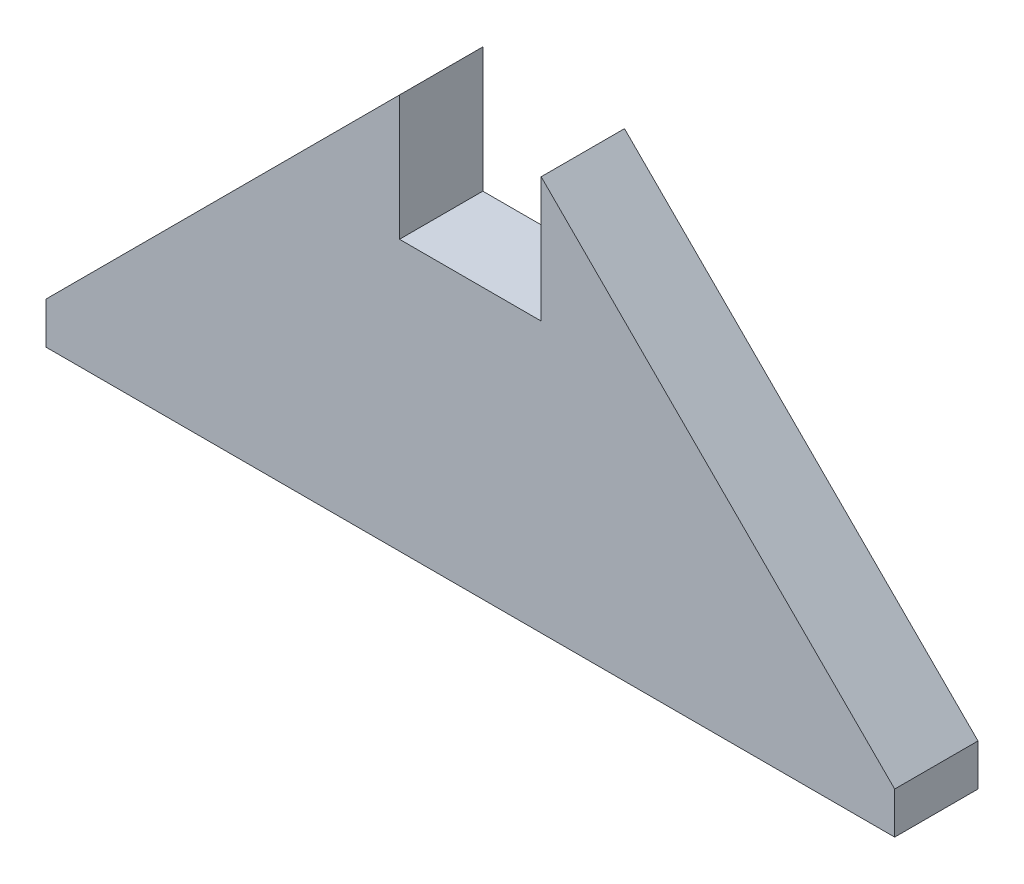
ISO-10303-21;
HEADER;
FILE_DESCRIPTION(('STEP AP214'),'2;1');
FILE_NAME('part.step','',(''),(''),'','','');
FILE_SCHEMA(('AUTOMOTIVE_DESIGN { 1 0 10303 214 1 1 1 1 }'));
ENDSEC;
DATA;
#1=APPLICATION_CONTEXT('core data for automotive mechanical design processes');
#2=APPLICATION_PROTOCOL_DEFINITION('international standard','automotive_design',2000,#1);
#3=PRODUCT_CONTEXT('',#1,'mechanical');
#4=PRODUCT('Part','Part','',(#3));
#5=PRODUCT_RELATED_PRODUCT_CATEGORY('part','',(#4));
#6=PRODUCT_DEFINITION_FORMATION('','',#4);
#7=PRODUCT_DEFINITION_CONTEXT('part definition',#1,'design');
#8=PRODUCT_DEFINITION('design','',#6,#7);
#9=PRODUCT_DEFINITION_SHAPE('','',#8);
#10=(LENGTH_UNIT() NAMED_UNIT(*) SI_UNIT(.MILLI.,.METRE.));
#11=(NAMED_UNIT(*) PLANE_ANGLE_UNIT() SI_UNIT($,.RADIAN.));
#12=(NAMED_UNIT(*) SI_UNIT($,.STERADIAN.) SOLID_ANGLE_UNIT());
#13=UNCERTAINTY_MEASURE_WITH_UNIT(LENGTH_MEASURE(1.E-05),#10,'distance_accuracy_value','');
#14=(GEOMETRIC_REPRESENTATION_CONTEXT(3) GLOBAL_UNCERTAINTY_ASSIGNED_CONTEXT((#13)) GLOBAL_UNIT_ASSIGNED_CONTEXT((#10,
#11,#12)) REPRESENTATION_CONTEXT('',''));
#15=CARTESIAN_POINT('',(0.,0.,0.));
#16=DIRECTION('',(0.,0.,1.));
#17=DIRECTION('',(1.,0.,0.));
#18=AXIS2_PLACEMENT_3D('',#15,#16,#17);
#19=CARTESIAN_POINT('',(0.,0.,10.));
#20=DIRECTION('',(0.707106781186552,-0.707106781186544,0.));
#21=DIRECTION('',(0.707106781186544,0.707106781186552,0.));
#22=AXIS2_PLACEMENT_3D('',#19,#20,#21);
#23=PLANE('',#22);
#24=DIRECTION('',(-0.707106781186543,-0.707106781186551,0.));
#25=VECTOR('',#24,1.);
#26=CARTESIAN_POINT('',(0.,0.,0.));
#27=LINE('',#26,#25);
#28=CARTESIAN_POINT('',(42.4264068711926,42.4264068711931,0.));
#29=VERTEX_POINT('',#28);
#30=CARTESIAN_POINT('',(0.,0.,0.));
#31=VERTEX_POINT('',#30);
#32=EDGE_CURVE('E129',#29,#31,#27,.T.);
#33=ORIENTED_EDGE('',*,*,#32,.T.);
#34=DIRECTION('',(0.,0.,-1.));
#35=VECTOR('',#34,1.);
#36=CARTESIAN_POINT('',(0.,0.,10.));
#37=LINE('',#36,#35);
#38=CARTESIAN_POINT('',(0.,0.,10.));
#39=VERTEX_POINT('',#38);
#40=EDGE_CURVE('E11',#39,#31,#37,.T.);
#41=ORIENTED_EDGE('',*,*,#40,.F.);
#42=DIRECTION('',(-0.707106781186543,-0.707106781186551,0.));
#43=VECTOR('',#42,1.);
#44=CARTESIAN_POINT('',(0.,0.,10.));
#45=LINE('',#44,#43);
#46=CARTESIAN_POINT('',(42.4264068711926,42.4264068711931,10.));
#47=VERTEX_POINT('',#46);
#48=EDGE_CURVE('E143',#47,#39,#45,.T.);
#49=ORIENTED_EDGE('',*,*,#48,.F.);
#50=DIRECTION('',(0.,0.,-1.));
#51=VECTOR('',#50,1.);
#52=CARTESIAN_POINT('',(42.4264068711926,42.4264068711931,10.));
#53=LINE('',#52,#51);
#54=EDGE_CURVE('E125',#47,#29,#53,.T.);
#55=ORIENTED_EDGE('',*,*,#54,.T.);
#56=EDGE_LOOP('',(#33,#41,#49,#55));
#57=FACE_BOUND('',#56,.T.);
#58=ADVANCED_FACE('F33',(#57),#23,.F.);
#59=CARTESIAN_POINT('',(0.,0.,10.));
#60=DIRECTION('',(1.,0.,0.));
#61=DIRECTION('',(0.,1.,0.));
#62=AXIS2_PLACEMENT_3D('',#59,#60,#61);
#63=PLANE('',#62);
#64=DIRECTION('',(0.,-1.,0.));
#65=VECTOR('',#64,1.);
#66=CARTESIAN_POINT('',(0.,0.,0.));
#67=LINE('',#66,#65);
#68=CARTESIAN_POINT('',(0.,-4.99999999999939,0.));
#69=VERTEX_POINT('',#68);
#70=EDGE_CURVE('E132',#31,#69,#67,.T.);
#71=ORIENTED_EDGE('',*,*,#70,.T.);
#72=DIRECTION('',(0.,0.,-1.));
#73=VECTOR('',#72,1.);
#74=CARTESIAN_POINT('',(0.,-4.99999999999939,10.));
#75=LINE('',#74,#73);
#76=CARTESIAN_POINT('',(0.,-4.99999999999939,10.));
#77=VERTEX_POINT('',#76);
#78=EDGE_CURVE('E41',#77,#69,#75,.T.);
#79=ORIENTED_EDGE('',*,*,#78,.F.);
#80=DIRECTION('',(0.,-1.,0.));
#81=VECTOR('',#80,1.);
#82=CARTESIAN_POINT('',(0.,0.,10.));
#83=LINE('',#82,#81);
#84=EDGE_CURVE('E92',#39,#77,#83,.T.);
#85=ORIENTED_EDGE('',*,*,#84,.F.);
#86=ORIENTED_EDGE('',*,*,#40,.T.);
#87=EDGE_LOOP('',(#71,#79,#85,#86));
#88=FACE_BOUND('',#87,.T.);
#89=ADVANCED_FACE('F178',(#88),#63,.F.);
#90=CARTESIAN_POINT('',(0.,-4.99999999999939,10.));
#91=DIRECTION('',(0.,1.,0.));
#92=DIRECTION('',(-1.,0.,0.));
#93=AXIS2_PLACEMENT_3D('',#90,#91,#92);
#94=PLANE('',#93);
#95=DIRECTION('',(1.,0.,0.));
#96=VECTOR('',#95,1.);
#97=CARTESIAN_POINT('',(0.,-4.99999999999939,0.));
#98=LINE('',#97,#96);
#99=CARTESIAN_POINT('',(101.852813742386,-4.99999999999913,0.));
#100=VERTEX_POINT('',#99);
#101=EDGE_CURVE('E134',#69,#100,#98,.T.);
#102=ORIENTED_EDGE('',*,*,#101,.T.);
#103=DIRECTION('',(0.,0.,-1.));
#104=VECTOR('',#103,1.);
#105=CARTESIAN_POINT('',(101.852813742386,-4.99999999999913,10.));
#106=LINE('',#105,#104);
#107=CARTESIAN_POINT('',(101.852813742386,-4.99999999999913,10.));
#108=VERTEX_POINT('',#107);
#109=EDGE_CURVE('E150',#108,#100,#106,.T.);
#110=ORIENTED_EDGE('',*,*,#109,.F.);
#111=DIRECTION('',(1.,0.,0.));
#112=VECTOR('',#111,1.);
#113=CARTESIAN_POINT('',(0.,-4.99999999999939,10.));
#114=LINE('',#113,#112);
#115=EDGE_CURVE('E158',#77,#108,#114,.T.);
#116=ORIENTED_EDGE('',*,*,#115,.F.);
#117=ORIENTED_EDGE('',*,*,#78,.T.);
#118=EDGE_LOOP('',(#102,#110,#116,#117));
#119=FACE_BOUND('',#118,.T.);
#120=ADVANCED_FACE('F156',(#119),#94,.F.);
#121=CARTESIAN_POINT('',(101.852813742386,-4.99999999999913,10.));
#122=DIRECTION('',(-1.,0.,0.));
#123=DIRECTION('',(0.,0.,1.));
#124=AXIS2_PLACEMENT_3D('',#121,#122,#123);
#125=PLANE('',#124);
#126=DIRECTION('',(0.,1.,0.));
#127=VECTOR('',#126,1.);
#128=CARTESIAN_POINT('',(101.852813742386,-4.99999999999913,0.));
#129=LINE('',#128,#127);
#130=CARTESIAN_POINT('',(101.852813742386,8.67688376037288E-13,0.));
#131=VERTEX_POINT('',#130);
#132=EDGE_CURVE('E136',#100,#131,#129,.T.);
#133=ORIENTED_EDGE('',*,*,#132,.T.);
#134=DIRECTION('',(0.,0.,-1.));
#135=VECTOR('',#134,1.);
#136=CARTESIAN_POINT('',(101.852813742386,8.67688376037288E-13,10.));
#137=LINE('',#136,#135);
#138=CARTESIAN_POINT('',(101.852813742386,8.67688376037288E-13,10.));
#139=VERTEX_POINT('',#138);
#140=EDGE_CURVE('E147',#139,#131,#137,.T.);
#141=ORIENTED_EDGE('',*,*,#140,.F.);
#142=DIRECTION('',(0.,1.,0.));
#143=VECTOR('',#142,1.);
#144=CARTESIAN_POINT('',(101.852813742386,-4.99999999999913,10.));
#145=LINE('',#144,#143);
#146=EDGE_CURVE('E170',#108,#139,#145,.T.);
#147=ORIENTED_EDGE('',*,*,#146,.F.);
#148=ORIENTED_EDGE('',*,*,#109,.T.);
#149=EDGE_LOOP('',(#133,#141,#147,#148));
#150=FACE_BOUND('',#149,.T.);
#151=ADVANCED_FACE('F166',(#150),#125,.F.);
#152=CARTESIAN_POINT('',(101.852813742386,8.67688376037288E-13,10.));
#153=DIRECTION('',(-0.707106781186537,-0.707106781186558,0.));
#154=DIRECTION('',(0.707106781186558,-0.707106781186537,0.));
#155=AXIS2_PLACEMENT_3D('',#152,#153,#154);
#156=PLANE('',#155);
#157=DIRECTION('',(-0.707106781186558,0.707106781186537,0.));
#158=VECTOR('',#157,1.);
#159=CARTESIAN_POINT('',(101.852813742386,8.67688376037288E-13,0.));
#160=LINE('',#159,#158);
#161=CARTESIAN_POINT('',(59.4264068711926,42.4264068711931,0.));
#162=VERTEX_POINT('',#161);
#163=EDGE_CURVE('E138',#131,#162,#160,.T.);
#164=ORIENTED_EDGE('',*,*,#163,.T.);
#165=DIRECTION('',(0.,0.,-1.));
#166=VECTOR('',#165,1.);
#167=CARTESIAN_POINT('',(59.4264068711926,42.4264068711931,10.));
#168=LINE('',#167,#166);
#169=CARTESIAN_POINT('',(59.4264068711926,42.4264068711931,10.));
#170=VERTEX_POINT('',#169);
#171=EDGE_CURVE('E120',#170,#162,#168,.T.);
#172=ORIENTED_EDGE('',*,*,#171,.F.);
#173=DIRECTION('',(-0.707106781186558,0.707106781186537,0.));
#174=VECTOR('',#173,1.);
#175=CARTESIAN_POINT('',(101.852813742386,8.67688376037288E-13,10.));
#176=LINE('',#175,#174);
#177=EDGE_CURVE('E111',#139,#170,#176,.T.);
#178=ORIENTED_EDGE('',*,*,#177,.F.);
#179=ORIENTED_EDGE('',*,*,#140,.T.);
#180=EDGE_LOOP('',(#164,#172,#178,#179));
#181=FACE_BOUND('',#180,.T.);
#182=ADVANCED_FACE('F169',(#181),#156,.F.);
#183=CARTESIAN_POINT('',(59.4264068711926,27.4264068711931,10.));
#184=DIRECTION('',(1.,0.,0.));
#185=DIRECTION('',(0.,0.,-1.));
#186=AXIS2_PLACEMENT_3D('',#183,#184,#185);
#187=PLANE('',#186);
#188=DIRECTION('',(0.,-1.,0.));
#189=VECTOR('',#188,1.);
#190=CARTESIAN_POINT('',(59.4264068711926,27.4264068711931,0.));
#191=LINE('',#190,#189);
#192=CARTESIAN_POINT('',(59.4264068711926,27.4264068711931,0.));
#193=VERTEX_POINT('',#192);
#194=EDGE_CURVE('E119',#162,#193,#191,.T.);
#195=ORIENTED_EDGE('',*,*,#194,.T.);
#196=DIRECTION('',(0.,0.,-1.));
#197=VECTOR('',#196,1.);
#198=CARTESIAN_POINT('',(59.4264068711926,27.4264068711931,10.));
#199=LINE('',#198,#197);
#200=CARTESIAN_POINT('',(59.4264068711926,27.4264068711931,10.));
#201=VERTEX_POINT('',#200);
#202=EDGE_CURVE('E116',#201,#193,#199,.T.);
#203=ORIENTED_EDGE('',*,*,#202,.F.);
#204=DIRECTION('',(0.,-1.,0.));
#205=VECTOR('',#204,1.);
#206=CARTESIAN_POINT('',(59.4264068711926,27.4264068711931,10.));
#207=LINE('',#206,#205);
#208=EDGE_CURVE('E105',#170,#201,#207,.T.);
#209=ORIENTED_EDGE('',*,*,#208,.F.);
#210=ORIENTED_EDGE('',*,*,#171,.T.);
#211=EDGE_LOOP('',(#195,#203,#209,#210));
#212=FACE_BOUND('',#211,.T.);
#213=ADVANCED_FACE('F117',(#212),#187,.F.);
#214=CARTESIAN_POINT('',(42.4264068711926,27.4264068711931,10.));
#215=DIRECTION('',(0.,-1.,0.));
#216=DIRECTION('',(1.,0.,0.));
#217=AXIS2_PLACEMENT_3D('',#214,#215,#216);
#218=PLANE('',#217);
#219=DIRECTION('',(-1.,0.,0.));
#220=VECTOR('',#219,1.);
#221=CARTESIAN_POINT('',(42.4264068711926,27.4264068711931,0.));
#222=LINE('',#221,#220);
#223=CARTESIAN_POINT('',(42.4264068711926,27.4264068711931,0.));
#224=VERTEX_POINT('',#223);
#225=EDGE_CURVE('E78',#193,#224,#222,.T.);
#226=ORIENTED_EDGE('',*,*,#225,.T.);
#227=DIRECTION('',(0.,0.,-1.));
#228=VECTOR('',#227,1.);
#229=CARTESIAN_POINT('',(42.4264068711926,27.4264068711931,10.));
#230=LINE('',#229,#228);
#231=CARTESIAN_POINT('',(42.4264068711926,27.4264068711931,10.));
#232=VERTEX_POINT('',#231);
#233=EDGE_CURVE('E121',#232,#224,#230,.T.);
#234=ORIENTED_EDGE('',*,*,#233,.F.);
#235=DIRECTION('',(-1.,0.,0.));
#236=VECTOR('',#235,1.);
#237=CARTESIAN_POINT('',(42.4264068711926,27.4264068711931,10.));
#238=LINE('',#237,#236);
#239=EDGE_CURVE('E109',#201,#232,#238,.T.);
#240=ORIENTED_EDGE('',*,*,#239,.F.);
#241=ORIENTED_EDGE('',*,*,#202,.T.);
#242=EDGE_LOOP('',(#226,#234,#240,#241));
#243=FACE_BOUND('',#242,.T.);
#244=ADVANCED_FACE('F123',(#243),#218,.F.);
#245=CARTESIAN_POINT('',(42.4264068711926,42.4264068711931,10.));
#246=DIRECTION('',(-1.,0.,0.));
#247=DIRECTION('',(0.,-1.,0.));
#248=AXIS2_PLACEMENT_3D('',#245,#246,#247);
#249=PLANE('',#248);
#250=DIRECTION('',(0.,1.,0.));
#251=VECTOR('',#250,1.);
#252=CARTESIAN_POINT('',(42.4264068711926,42.4264068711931,0.));
#253=LINE('',#252,#251);
#254=EDGE_CURVE('E84',#224,#29,#253,.T.);
#255=ORIENTED_EDGE('',*,*,#254,.T.);
#256=ORIENTED_EDGE('',*,*,#54,.F.);
#257=DIRECTION('',(0.,1.,0.));
#258=VECTOR('',#257,1.);
#259=CARTESIAN_POINT('',(42.4264068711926,42.4264068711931,10.));
#260=LINE('',#259,#258);
#261=EDGE_CURVE('E49',#232,#47,#260,.T.);
#262=ORIENTED_EDGE('',*,*,#261,.F.);
#263=ORIENTED_EDGE('',*,*,#233,.T.);
#264=EDGE_LOOP('',(#255,#256,#262,#263));
#265=FACE_BOUND('',#264,.T.);
#266=ADVANCED_FACE('F194',(#265),#249,.F.);
#267=CARTESIAN_POINT('',(0.,0.,10.));
#268=DIRECTION('',(0.,0.,1.));
#269=DIRECTION('',(1.,0.,0.));
#270=AXIS2_PLACEMENT_3D('',#267,#268,#269);
#271=PLANE('',#270);
#272=ORIENTED_EDGE('',*,*,#48,.T.);
#273=ORIENTED_EDGE('',*,*,#84,.T.);
#274=ORIENTED_EDGE('',*,*,#115,.T.);
#275=ORIENTED_EDGE('',*,*,#146,.T.);
#276=ORIENTED_EDGE('',*,*,#177,.T.);
#277=ORIENTED_EDGE('',*,*,#208,.T.);
#278=ORIENTED_EDGE('',*,*,#239,.T.);
#279=ORIENTED_EDGE('',*,*,#261,.T.);
#280=EDGE_LOOP('',(#272,#273,#274,#275,#276,#277,#278,#279));
#281=FACE_BOUND('',#280,.T.);
#282=ADVANCED_FACE('F107',(#281),#271,.T.);
#283=CARTESIAN_POINT('',(0.,0.,0.));
#284=DIRECTION('',(0.,0.,1.));
#285=DIRECTION('',(1.,0.,0.));
#286=AXIS2_PLACEMENT_3D('',#283,#284,#285);
#287=PLANE('',#286);
#288=ORIENTED_EDGE('',*,*,#32,.F.);
#289=ORIENTED_EDGE('',*,*,#254,.F.);
#290=ORIENTED_EDGE('',*,*,#225,.F.);
#291=ORIENTED_EDGE('',*,*,#194,.F.);
#292=ORIENTED_EDGE('',*,*,#163,.F.);
#293=ORIENTED_EDGE('',*,*,#132,.F.);
#294=ORIENTED_EDGE('',*,*,#101,.F.);
#295=ORIENTED_EDGE('',*,*,#70,.F.);
#296=EDGE_LOOP('',(#288,#289,#290,#291,#292,#293,#294,#295));
#297=FACE_BOUND('',#296,.T.);
#298=ADVANCED_FACE('F162',(#297),#287,.F.);
#299=CLOSED_SHELL('',(#58,#89,#120,#151,#182,#213,#244,#266,#282,#298));
#300=MANIFOLD_SOLID_BREP('B2',#299);
#301=ADVANCED_BREP_SHAPE_REPRESENTATION('',(#18,#300),#14);
#302=SHAPE_DEFINITION_REPRESENTATION(#9,#301);
ENDSEC;
END-ISO-10303-21;
